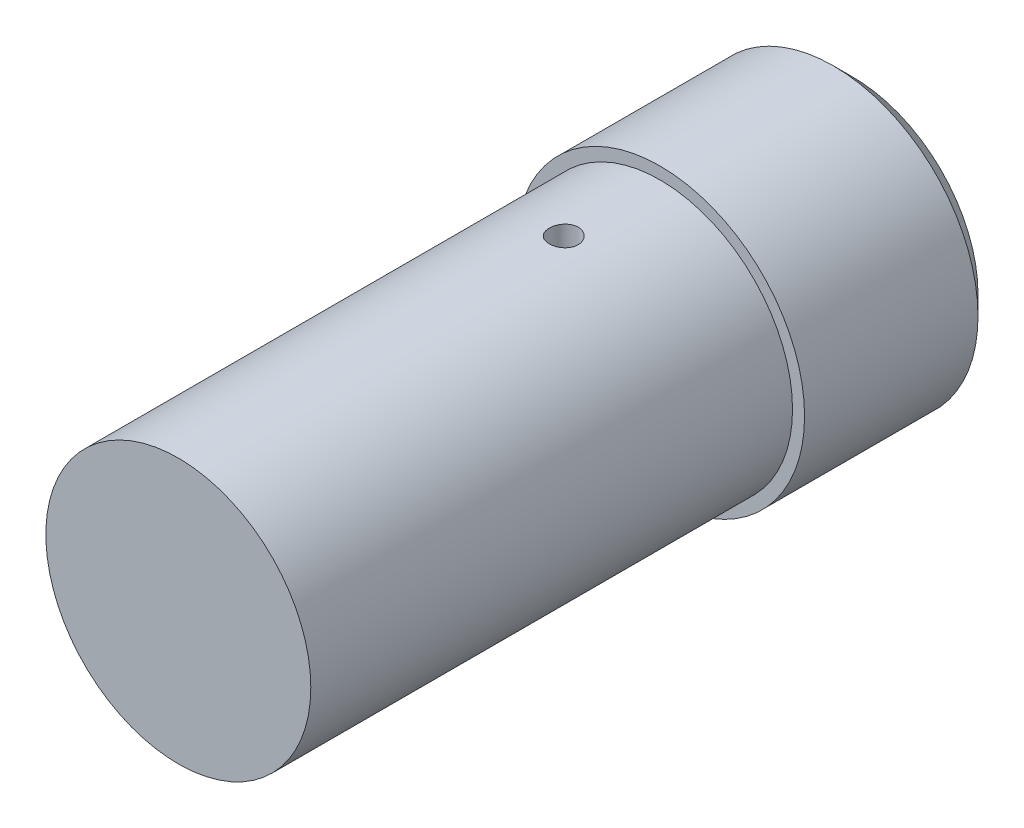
from build123d import *

# Parameters (mm, degrees)
ESQUISSE1_R             = 30
BASE_EXTRUSION_DEPTH    = 40
ESQUISSE2_R             = 27.5
BOSS_EXTRU_1_DEPTH      = 100
ESQUISSE3_R             = 3
ENL_V_MAT_EXTRU_1_DEPTH = 30
CHANFREIN1_SIZE         = 4


with BuildPart() as part:
    # Esquisse1 → Base-Extrusion (new body)
    with BuildSketch(Plane.XY):
        Circle(ESQUISSE1_R)
    extrude(amount=BASE_EXTRUSION_DEPTH)

    # Esquisse2 → Boss.-Extru.1 (add)
    with BuildSketch(Plane.XY.offset(40)):
        Circle(ESQUISSE2_R)
    extrude(amount=BOSS_EXTRU_1_DEPTH)

    # Esquisse3 → Enl_v. mat.-Extru.1 (cut)
    with BuildSketch(Plane(origin=(0, 30, 0), x_dir=(-1, 0, 0), z_dir=(0, 1, 0))):
        with Locations(Location((0, 60, 0), (0, 0, 90))):
            Circle(ESQUISSE3_R)
    extrude(amount=-ENL_V_MAT_EXTRU_1_DEPTH, mode=Mode.SUBTRACT)

    # Chanfrein1
    chanfrein1_edges = [part.edges().sort_by_distance(p)[0] for p in [
        (-30, 0, 0),
    ]]
    chamfer(chanfrein1_edges, length=CHANFREIN1_SIZE)


solid = part.part
